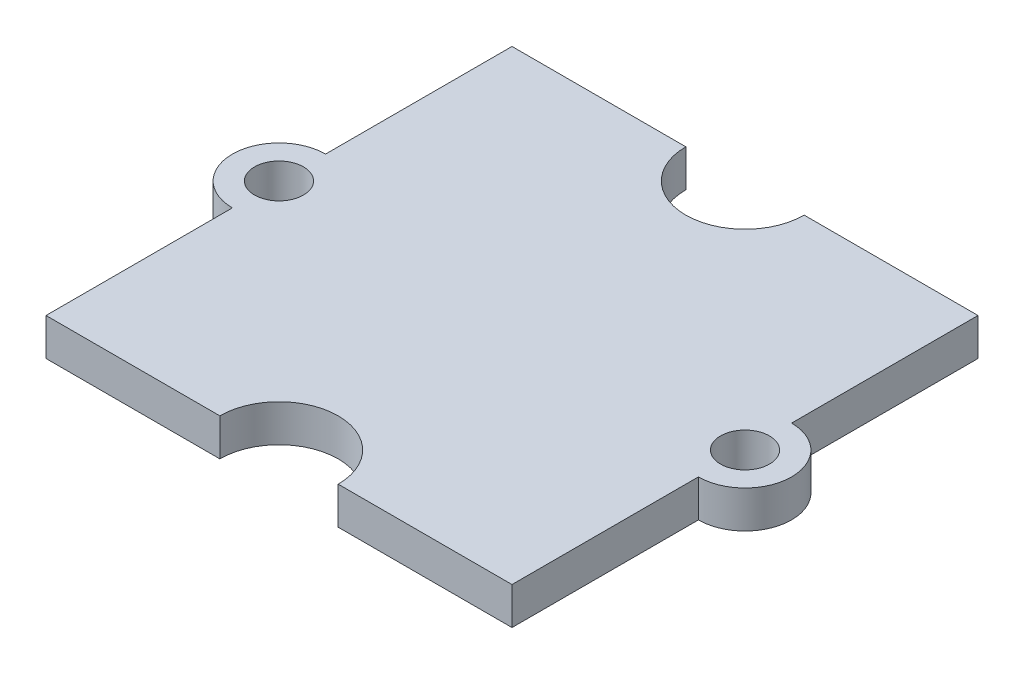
ISO-10303-21;
HEADER;
FILE_DESCRIPTION(('STEP AP214'),'2;1');
FILE_NAME('part.step','',(''),(''),'','','');
FILE_SCHEMA(('AUTOMOTIVE_DESIGN { 1 0 10303 214 1 1 1 1 }'));
ENDSEC;
DATA;
#1=APPLICATION_CONTEXT('core data for automotive mechanical design processes');
#2=APPLICATION_PROTOCOL_DEFINITION('international standard','automotive_design',2000,#1);
#3=PRODUCT_CONTEXT('',#1,'mechanical');
#4=PRODUCT('Part','Part','',(#3));
#5=PRODUCT_RELATED_PRODUCT_CATEGORY('part','',(#4));
#6=PRODUCT_DEFINITION_FORMATION('','',#4);
#7=PRODUCT_DEFINITION_CONTEXT('part definition',#1,'design');
#8=PRODUCT_DEFINITION('design','',#6,#7);
#9=PRODUCT_DEFINITION_SHAPE('','',#8);
#10=(LENGTH_UNIT() NAMED_UNIT(*) SI_UNIT(.MILLI.,.METRE.));
#11=(NAMED_UNIT(*) PLANE_ANGLE_UNIT() SI_UNIT($,.RADIAN.));
#12=(NAMED_UNIT(*) SI_UNIT($,.STERADIAN.) SOLID_ANGLE_UNIT());
#13=UNCERTAINTY_MEASURE_WITH_UNIT(LENGTH_MEASURE(1.E-05),#10,'distance_accuracy_value','');
#14=(GEOMETRIC_REPRESENTATION_CONTEXT(3) GLOBAL_UNCERTAINTY_ASSIGNED_CONTEXT((#13)) GLOBAL_UNIT_ASSIGNED_CONTEXT((#10,
#11,#12)) REPRESENTATION_CONTEXT('',''));
#15=CARTESIAN_POINT('',(0.,0.,0.));
#16=DIRECTION('',(0.,0.,1.));
#17=DIRECTION('',(1.,0.,0.));
#18=AXIS2_PLACEMENT_3D('',#15,#16,#17);
#19=CARTESIAN_POINT('',(-10.,1.6,0.));
#20=DIRECTION('',(0.,-1.,0.));
#21=DIRECTION('',(0.,0.,-1.));
#22=AXIS2_PLACEMENT_3D('',#19,#20,#21);
#23=PLANE('',#22);
#24=DIRECTION('',(0.,0.,1.));
#25=VECTOR('',#24,1.);
#26=CARTESIAN_POINT('',(-10.,1.6,-9.99999999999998));
#27=LINE('',#26,#25);
#28=CARTESIAN_POINT('',(-10.,1.6,-9.99999999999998));
#29=VERTEX_POINT('',#28);
#30=CARTESIAN_POINT('',(-10.,1.6,-1.99999999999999));
#31=VERTEX_POINT('',#30);
#32=EDGE_CURVE('E179',#29,#31,#27,.T.);
#33=ORIENTED_EDGE('',*,*,#32,.T.);
#34=CARTESIAN_POINT('',(-10.,1.6,0.));
#35=DIRECTION('',(0.,1.,0.));
#36=DIRECTION('',(0.,0.,-1.));
#37=AXIS2_PLACEMENT_3D('',#34,#35,#36);
#38=CIRCLE('',#37,2.);
#39=CARTESIAN_POINT('',(-10.,1.6,2.00000000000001));
#40=VERTEX_POINT('',#39);
#41=EDGE_CURVE('E107',#31,#40,#38,.T.);
#42=ORIENTED_EDGE('',*,*,#41,.T.);
#43=DIRECTION('',(0.,0.,1.));
#44=VECTOR('',#43,1.);
#45=CARTESIAN_POINT('',(-10.,1.6,2.00000000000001));
#46=LINE('',#45,#44);
#47=CARTESIAN_POINT('',(-10.,1.6,10.));
#48=VERTEX_POINT('',#47);
#49=EDGE_CURVE('E206',#40,#48,#46,.T.);
#50=ORIENTED_EDGE('',*,*,#49,.T.);
#51=DIRECTION('',(1.,0.,0.));
#52=VECTOR('',#51,1.);
#53=CARTESIAN_POINT('',(-10.,1.6,10.));
#54=LINE('',#53,#52);
#55=CARTESIAN_POINT('',(-2.54,1.6,9.99999999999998));
#56=VERTEX_POINT('',#55);
#57=EDGE_CURVE('E225',#48,#56,#54,.T.);
#58=ORIENTED_EDGE('',*,*,#57,.T.);
#59=CARTESIAN_POINT('',(0.,1.6,9.99999999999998));
#60=DIRECTION('',(0.,-1.,0.));
#61=DIRECTION('',(0.,0.,-1.));
#62=AXIS2_PLACEMENT_3D('',#59,#60,#61);
#63=CIRCLE('',#62,2.54);
#64=CARTESIAN_POINT('',(2.53999999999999,1.6,9.99999999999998));
#65=VERTEX_POINT('',#64);
#66=EDGE_CURVE('E222',#56,#65,#63,.T.);
#67=ORIENTED_EDGE('',*,*,#66,.T.);
#68=DIRECTION('',(1.,0.,0.));
#69=VECTOR('',#68,1.);
#70=CARTESIAN_POINT('',(2.53999999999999,1.6,9.99999999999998));
#71=LINE('',#70,#69);
#72=CARTESIAN_POINT('',(10.,1.6,10.));
#73=VERTEX_POINT('',#72);
#74=EDGE_CURVE('E224',#65,#73,#71,.T.);
#75=ORIENTED_EDGE('',*,*,#74,.T.);
#76=DIRECTION('',(0.,0.,-1.));
#77=VECTOR('',#76,1.);
#78=CARTESIAN_POINT('',(10.,1.6,2.00000000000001));
#79=LINE('',#78,#77);
#80=CARTESIAN_POINT('',(10.,1.6,2.00000000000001));
#81=VERTEX_POINT('',#80);
#82=EDGE_CURVE('E227',#73,#81,#79,.T.);
#83=ORIENTED_EDGE('',*,*,#82,.T.);
#84=CARTESIAN_POINT('',(10.,1.6,0.));
#85=DIRECTION('',(0.,1.,0.));
#86=DIRECTION('',(0.,0.,1.));
#87=AXIS2_PLACEMENT_3D('',#84,#85,#86);
#88=CIRCLE('',#87,2.);
#89=CARTESIAN_POINT('',(10.,1.6,-1.99999999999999));
#90=VERTEX_POINT('',#89);
#91=EDGE_CURVE('E233',#81,#90,#88,.T.);
#92=ORIENTED_EDGE('',*,*,#91,.T.);
#93=DIRECTION('',(0.,0.,-1.));
#94=VECTOR('',#93,1.);
#95=CARTESIAN_POINT('',(10.,1.6,-9.99999999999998));
#96=LINE('',#95,#94);
#97=CARTESIAN_POINT('',(10.,1.6,-9.99999999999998));
#98=VERTEX_POINT('',#97);
#99=EDGE_CURVE('E138',#90,#98,#96,.T.);
#100=ORIENTED_EDGE('',*,*,#99,.T.);
#101=DIRECTION('',(-1.,0.,0.));
#102=VECTOR('',#101,1.);
#103=CARTESIAN_POINT('',(2.54,1.6,-9.99999999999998));
#104=LINE('',#103,#102);
#105=CARTESIAN_POINT('',(2.54,1.6,-9.99999999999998));
#106=VERTEX_POINT('',#105);
#107=EDGE_CURVE('E132',#98,#106,#104,.T.);
#108=ORIENTED_EDGE('',*,*,#107,.T.);
#109=CARTESIAN_POINT('',(0.,1.6,-9.99999999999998));
#110=DIRECTION('',(0.,-1.,0.));
#111=DIRECTION('',(0.,0.,1.));
#112=AXIS2_PLACEMENT_3D('',#109,#110,#111);
#113=CIRCLE('',#112,2.54);
#114=CARTESIAN_POINT('',(-2.54,1.6,-9.99999999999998));
#115=VERTEX_POINT('',#114);
#116=EDGE_CURVE('E136',#106,#115,#113,.T.);
#117=ORIENTED_EDGE('',*,*,#116,.T.);
#118=DIRECTION('',(-1.,0.,0.));
#119=VECTOR('',#118,1.);
#120=CARTESIAN_POINT('',(-10.,1.6,-9.99999999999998));
#121=LINE('',#120,#119);
#122=EDGE_CURVE('E52',#115,#29,#121,.T.);
#123=ORIENTED_EDGE('',*,*,#122,.T.);
#124=EDGE_LOOP('',(#33,#42,#50,#58,#67,#75,#83,#92,#100,#108,#117,#123));
#125=FACE_BOUND('',#124,.T.);
#126=CARTESIAN_POINT('',(10.,1.6,0.));
#127=DIRECTION('',(0.,1.,0.));
#128=DIRECTION('',(0.,0.,1.));
#129=AXIS2_PLACEMENT_3D('',#126,#127,#128);
#130=CIRCLE('',#129,1.05);
#131=CARTESIAN_POINT('',(10.,1.6,1.05000000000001));
#132=VERTEX_POINT('',#131);
#133=EDGE_CURVE('E160',#132,#132,#130,.T.);
#134=ORIENTED_EDGE('',*,*,#133,.F.);
#135=EDGE_LOOP('',(#134));
#136=FACE_BOUND('',#135,.T.);
#137=CARTESIAN_POINT('',(-10.,1.6,0.));
#138=DIRECTION('',(0.,1.,0.));
#139=DIRECTION('',(0.,0.,-1.));
#140=AXIS2_PLACEMENT_3D('',#137,#138,#139);
#141=CIRCLE('',#140,1.05);
#142=CARTESIAN_POINT('',(-10.,1.6,-1.04999999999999));
#143=VERTEX_POINT('',#142);
#144=EDGE_CURVE('E274',#143,#143,#141,.T.);
#145=ORIENTED_EDGE('',*,*,#144,.F.);
#146=EDGE_LOOP('',(#145));
#147=FACE_BOUND('',#146,.T.);
#148=ADVANCED_FACE('F35',(#125,#136,#147),#23,.F.);
#149=CARTESIAN_POINT('',(-10.,0.,0.));
#150=DIRECTION('',(0.,-1.,0.));
#151=DIRECTION('',(0.,0.,-1.));
#152=AXIS2_PLACEMENT_3D('',#149,#150,#151);
#153=PLANE('',#152);
#154=CARTESIAN_POINT('',(10.,0.,0.));
#155=DIRECTION('',(0.,1.,0.));
#156=DIRECTION('',(0.,0.,1.));
#157=AXIS2_PLACEMENT_3D('',#154,#155,#156);
#158=CIRCLE('',#157,1.05);
#159=CARTESIAN_POINT('',(10.,0.,1.05000000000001));
#160=VERTEX_POINT('',#159);
#161=EDGE_CURVE('E279',#160,#160,#158,.T.);
#162=ORIENTED_EDGE('',*,*,#161,.T.);
#163=EDGE_LOOP('',(#162));
#164=FACE_BOUND('',#163,.T.);
#165=DIRECTION('',(0.,0.,1.));
#166=VECTOR('',#165,1.);
#167=CARTESIAN_POINT('',(-10.,0.,-9.99999999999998));
#168=LINE('',#167,#166);
#169=CARTESIAN_POINT('',(-10.,0.,-9.99999999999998));
#170=VERTEX_POINT('',#169);
#171=CARTESIAN_POINT('',(-10.,0.,-1.99999999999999));
#172=VERTEX_POINT('',#171);
#173=EDGE_CURVE('E156',#170,#172,#168,.T.);
#174=ORIENTED_EDGE('',*,*,#173,.F.);
#175=DIRECTION('',(-1.,0.,0.));
#176=VECTOR('',#175,1.);
#177=CARTESIAN_POINT('',(-10.,0.,-9.99999999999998));
#178=LINE('',#177,#176);
#179=CARTESIAN_POINT('',(-2.54,0.,-9.99999999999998));
#180=VERTEX_POINT('',#179);
#181=EDGE_CURVE('E99',#180,#170,#178,.T.);
#182=ORIENTED_EDGE('',*,*,#181,.F.);
#183=CARTESIAN_POINT('',(0.,0.,-9.99999999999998));
#184=DIRECTION('',(0.,-1.,0.));
#185=DIRECTION('',(0.,0.,1.));
#186=AXIS2_PLACEMENT_3D('',#183,#184,#185);
#187=CIRCLE('',#186,2.54);
#188=CARTESIAN_POINT('',(2.54,0.,-9.99999999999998));
#189=VERTEX_POINT('',#188);
#190=EDGE_CURVE('E93',#189,#180,#187,.T.);
#191=ORIENTED_EDGE('',*,*,#190,.F.);
#192=DIRECTION('',(-1.,0.,0.));
#193=VECTOR('',#192,1.);
#194=CARTESIAN_POINT('',(2.54,0.,-9.99999999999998));
#195=LINE('',#194,#193);
#196=CARTESIAN_POINT('',(10.,0.,-9.99999999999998));
#197=VERTEX_POINT('',#196);
#198=EDGE_CURVE('E146',#197,#189,#195,.T.);
#199=ORIENTED_EDGE('',*,*,#198,.F.);
#200=DIRECTION('',(0.,0.,-1.));
#201=VECTOR('',#200,1.);
#202=CARTESIAN_POINT('',(10.,0.,-9.99999999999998));
#203=LINE('',#202,#201);
#204=CARTESIAN_POINT('',(10.,0.,-1.99999999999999));
#205=VERTEX_POINT('',#204);
#206=EDGE_CURVE('E174',#205,#197,#203,.T.);
#207=ORIENTED_EDGE('',*,*,#206,.F.);
#208=CARTESIAN_POINT('',(10.,0.,0.));
#209=DIRECTION('',(0.,1.,0.));
#210=DIRECTION('',(0.,0.,1.));
#211=AXIS2_PLACEMENT_3D('',#208,#209,#210);
#212=CIRCLE('',#211,2.);
#213=CARTESIAN_POINT('',(10.,0.,2.00000000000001));
#214=VERTEX_POINT('',#213);
#215=EDGE_CURVE('E172',#214,#205,#212,.T.);
#216=ORIENTED_EDGE('',*,*,#215,.F.);
#217=DIRECTION('',(0.,0.,-1.));
#218=VECTOR('',#217,1.);
#219=CARTESIAN_POINT('',(10.,0.,2.00000000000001));
#220=LINE('',#219,#218);
#221=CARTESIAN_POINT('',(10.,0.,10.));
#222=VERTEX_POINT('',#221);
#223=EDGE_CURVE('E170',#222,#214,#220,.T.);
#224=ORIENTED_EDGE('',*,*,#223,.F.);
#225=DIRECTION('',(1.,0.,0.));
#226=VECTOR('',#225,1.);
#227=CARTESIAN_POINT('',(2.53999999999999,0.,9.99999999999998));
#228=LINE('',#227,#226);
#229=CARTESIAN_POINT('',(2.53999999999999,0.,9.99999999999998));
#230=VERTEX_POINT('',#229);
#231=EDGE_CURVE('E168',#230,#222,#228,.T.);
#232=ORIENTED_EDGE('',*,*,#231,.F.);
#233=CARTESIAN_POINT('',(0.,0.,9.99999999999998));
#234=DIRECTION('',(0.,-1.,0.));
#235=DIRECTION('',(0.,0.,-1.));
#236=AXIS2_PLACEMENT_3D('',#233,#234,#235);
#237=CIRCLE('',#236,2.54);
#238=CARTESIAN_POINT('',(-2.54,0.,9.99999999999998));
#239=VERTEX_POINT('',#238);
#240=EDGE_CURVE('E166',#239,#230,#237,.T.);
#241=ORIENTED_EDGE('',*,*,#240,.F.);
#242=DIRECTION('',(1.,0.,0.));
#243=VECTOR('',#242,1.);
#244=CARTESIAN_POINT('',(-10.,0.,10.));
#245=LINE('',#244,#243);
#246=CARTESIAN_POINT('',(-10.,0.,10.));
#247=VERTEX_POINT('',#246);
#248=EDGE_CURVE('E164',#247,#239,#245,.T.);
#249=ORIENTED_EDGE('',*,*,#248,.F.);
#250=DIRECTION('',(0.,0.,1.));
#251=VECTOR('',#250,1.);
#252=CARTESIAN_POINT('',(-10.,0.,2.00000000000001));
#253=LINE('',#252,#251);
#254=CARTESIAN_POINT('',(-10.,0.,2.00000000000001));
#255=VERTEX_POINT('',#254);
#256=EDGE_CURVE('E162',#255,#247,#253,.T.);
#257=ORIENTED_EDGE('',*,*,#256,.F.);
#258=CARTESIAN_POINT('',(-10.,0.,0.));
#259=DIRECTION('',(0.,1.,0.));
#260=DIRECTION('',(0.,0.,-1.));
#261=AXIS2_PLACEMENT_3D('',#258,#259,#260);
#262=CIRCLE('',#261,2.);
#263=EDGE_CURVE('E159',#172,#255,#262,.T.);
#264=ORIENTED_EDGE('',*,*,#263,.F.);
#265=EDGE_LOOP('',(#174,#182,#191,#199,#207,#216,#224,#232,#241,#249,#257,#264));
#266=FACE_BOUND('',#265,.T.);
#267=CARTESIAN_POINT('',(-10.,0.,0.));
#268=DIRECTION('',(0.,1.,0.));
#269=DIRECTION('',(0.,0.,-1.));
#270=AXIS2_PLACEMENT_3D('',#267,#268,#269);
#271=CIRCLE('',#270,1.05);
#272=CARTESIAN_POINT('',(-10.,0.,-1.04999999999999));
#273=VERTEX_POINT('',#272);
#274=EDGE_CURVE('E277',#273,#273,#271,.T.);
#275=ORIENTED_EDGE('',*,*,#274,.T.);
#276=EDGE_LOOP('',(#275));
#277=FACE_BOUND('',#276,.T.);
#278=ADVANCED_FACE('F210',(#164,#266,#277),#153,.T.);
#279=CARTESIAN_POINT('',(-10.,1.6,-9.99999999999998));
#280=DIRECTION('',(1.,0.,0.));
#281=DIRECTION('',(0.,0.,-1.));
#282=AXIS2_PLACEMENT_3D('',#279,#280,#281);
#283=PLANE('',#282);
#284=ORIENTED_EDGE('',*,*,#173,.T.);
#285=DIRECTION('',(0.,-1.,0.));
#286=VECTOR('',#285,1.);
#287=CARTESIAN_POINT('',(-10.,1.6,-1.99999999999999));
#288=LINE('',#287,#286);
#289=EDGE_CURVE('E11',#31,#172,#288,.T.);
#290=ORIENTED_EDGE('',*,*,#289,.F.);
#291=ORIENTED_EDGE('',*,*,#32,.F.);
#292=DIRECTION('',(0.,-1.,0.));
#293=VECTOR('',#292,1.);
#294=CARTESIAN_POINT('',(-10.,1.6,-9.99999999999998));
#295=LINE('',#294,#293);
#296=EDGE_CURVE('E152',#29,#170,#295,.T.);
#297=ORIENTED_EDGE('',*,*,#296,.T.);
#298=EDGE_LOOP('',(#284,#290,#291,#297));
#299=FACE_BOUND('',#298,.T.);
#300=ADVANCED_FACE('F37',(#299),#283,.F.);
#301=CARTESIAN_POINT('',(-10.,1.6,0.));
#302=DIRECTION('',(0.,-1.,0.));
#303=DIRECTION('',(0.,0.,-1.));
#304=AXIS2_PLACEMENT_3D('',#301,#302,#303);
#305=CYLINDRICAL_SURFACE('',#304,2.);
#306=ORIENTED_EDGE('',*,*,#263,.T.);
#307=DIRECTION('',(0.,-1.,0.));
#308=VECTOR('',#307,1.);
#309=CARTESIAN_POINT('',(-10.,1.6,2.00000000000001));
#310=LINE('',#309,#308);
#311=EDGE_CURVE('E44',#40,#255,#310,.T.);
#312=ORIENTED_EDGE('',*,*,#311,.F.);
#313=ORIENTED_EDGE('',*,*,#41,.F.);
#314=ORIENTED_EDGE('',*,*,#289,.T.);
#315=EDGE_LOOP('',(#306,#312,#313,#314));
#316=FACE_BOUND('',#315,.T.);
#317=ADVANCED_FACE('F374',(#316),#305,.T.);
#318=CARTESIAN_POINT('',(-10.,1.6,2.00000000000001));
#319=DIRECTION('',(1.,0.,0.));
#320=DIRECTION('',(0.,0.,-1.));
#321=AXIS2_PLACEMENT_3D('',#318,#319,#320);
#322=PLANE('',#321);
#323=ORIENTED_EDGE('',*,*,#256,.T.);
#324=DIRECTION('',(0.,-1.,0.));
#325=VECTOR('',#324,1.);
#326=CARTESIAN_POINT('',(-10.,1.6,10.));
#327=LINE('',#326,#325);
#328=EDGE_CURVE('E198',#48,#247,#327,.T.);
#329=ORIENTED_EDGE('',*,*,#328,.F.);
#330=ORIENTED_EDGE('',*,*,#49,.F.);
#331=ORIENTED_EDGE('',*,*,#311,.T.);
#332=EDGE_LOOP('',(#323,#329,#330,#331));
#333=FACE_BOUND('',#332,.T.);
#334=ADVANCED_FACE('F204',(#333),#322,.F.);
#335=CARTESIAN_POINT('',(-10.,1.6,10.));
#336=DIRECTION('',(0.,0.,-1.));
#337=DIRECTION('',(-1.,0.,0.));
#338=AXIS2_PLACEMENT_3D('',#335,#336,#337);
#339=PLANE('',#338);
#340=ORIENTED_EDGE('',*,*,#248,.T.);
#341=DIRECTION('',(0.,-1.,0.));
#342=VECTOR('',#341,1.);
#343=CARTESIAN_POINT('',(-2.54,1.6,9.99999999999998));
#344=LINE('',#343,#342);
#345=EDGE_CURVE('E195',#56,#239,#344,.T.);
#346=ORIENTED_EDGE('',*,*,#345,.F.);
#347=ORIENTED_EDGE('',*,*,#57,.F.);
#348=ORIENTED_EDGE('',*,*,#328,.T.);
#349=EDGE_LOOP('',(#340,#346,#347,#348));
#350=FACE_BOUND('',#349,.T.);
#351=ADVANCED_FACE('F216',(#350),#339,.F.);
#352=CARTESIAN_POINT('',(0.,1.6,9.99999999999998));
#353=DIRECTION('',(0.,-1.,0.));
#354=DIRECTION('',(0.,0.,-1.));
#355=AXIS2_PLACEMENT_3D('',#352,#353,#354);
#356=CYLINDRICAL_SURFACE('',#355,2.54);
#357=ORIENTED_EDGE('',*,*,#240,.T.);
#358=DIRECTION('',(0.,-1.,0.));
#359=VECTOR('',#358,1.);
#360=CARTESIAN_POINT('',(2.53999999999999,1.6,9.99999999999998));
#361=LINE('',#360,#359);
#362=EDGE_CURVE('E192',#65,#230,#361,.T.);
#363=ORIENTED_EDGE('',*,*,#362,.F.);
#364=ORIENTED_EDGE('',*,*,#66,.F.);
#365=ORIENTED_EDGE('',*,*,#345,.T.);
#366=EDGE_LOOP('',(#357,#363,#364,#365));
#367=FACE_BOUND('',#366,.T.);
#368=ADVANCED_FACE('F220',(#367),#356,.F.);
#369=CARTESIAN_POINT('',(2.53999999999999,1.6,9.99999999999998));
#370=DIRECTION('',(0.,0.,-1.));
#371=DIRECTION('',(-1.,0.,0.));
#372=AXIS2_PLACEMENT_3D('',#369,#370,#371);
#373=PLANE('',#372);
#374=ORIENTED_EDGE('',*,*,#231,.T.);
#375=DIRECTION('',(0.,-1.,0.));
#376=VECTOR('',#375,1.);
#377=CARTESIAN_POINT('',(10.,1.6,10.));
#378=LINE('',#377,#376);
#379=EDGE_CURVE('E189',#73,#222,#378,.T.);
#380=ORIENTED_EDGE('',*,*,#379,.F.);
#381=ORIENTED_EDGE('',*,*,#74,.F.);
#382=ORIENTED_EDGE('',*,*,#362,.T.);
#383=EDGE_LOOP('',(#374,#380,#381,#382));
#384=FACE_BOUND('',#383,.T.);
#385=ADVANCED_FACE('F339',(#384),#373,.F.);
#386=CARTESIAN_POINT('',(10.,1.6,2.00000000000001));
#387=DIRECTION('',(-1.,0.,0.));
#388=DIRECTION('',(0.,0.,1.));
#389=AXIS2_PLACEMENT_3D('',#386,#387,#388);
#390=PLANE('',#389);
#391=ORIENTED_EDGE('',*,*,#223,.T.);
#392=DIRECTION('',(0.,-1.,0.));
#393=VECTOR('',#392,1.);
#394=CARTESIAN_POINT('',(10.,1.6,2.00000000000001));
#395=LINE('',#394,#393);
#396=EDGE_CURVE('E186',#81,#214,#395,.T.);
#397=ORIENTED_EDGE('',*,*,#396,.F.);
#398=ORIENTED_EDGE('',*,*,#82,.F.);
#399=ORIENTED_EDGE('',*,*,#379,.T.);
#400=EDGE_LOOP('',(#391,#397,#398,#399));
#401=FACE_BOUND('',#400,.T.);
#402=ADVANCED_FACE('F330',(#401),#390,.F.);
#403=CARTESIAN_POINT('',(10.,1.6,0.));
#404=DIRECTION('',(0.,-1.,0.));
#405=DIRECTION('',(0.,0.,-1.));
#406=AXIS2_PLACEMENT_3D('',#403,#404,#405);
#407=CYLINDRICAL_SURFACE('',#406,2.);
#408=ORIENTED_EDGE('',*,*,#215,.T.);
#409=DIRECTION('',(0.,-1.,0.));
#410=VECTOR('',#409,1.);
#411=CARTESIAN_POINT('',(10.,1.6,-1.99999999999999));
#412=LINE('',#411,#410);
#413=EDGE_CURVE('E183',#90,#205,#412,.T.);
#414=ORIENTED_EDGE('',*,*,#413,.F.);
#415=ORIENTED_EDGE('',*,*,#91,.F.);
#416=ORIENTED_EDGE('',*,*,#396,.T.);
#417=EDGE_LOOP('',(#408,#414,#415,#416));
#418=FACE_BOUND('',#417,.T.);
#419=ADVANCED_FACE('F239',(#418),#407,.T.);
#420=CARTESIAN_POINT('',(10.,1.6,-9.99999999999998));
#421=DIRECTION('',(-1.,0.,0.));
#422=DIRECTION('',(0.,0.,1.));
#423=AXIS2_PLACEMENT_3D('',#420,#421,#422);
#424=PLANE('',#423);
#425=ORIENTED_EDGE('',*,*,#206,.T.);
#426=DIRECTION('',(0.,-1.,0.));
#427=VECTOR('',#426,1.);
#428=CARTESIAN_POINT('',(10.,1.6,-9.99999999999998));
#429=LINE('',#428,#427);
#430=EDGE_CURVE('E147',#98,#197,#429,.T.);
#431=ORIENTED_EDGE('',*,*,#430,.F.);
#432=ORIENTED_EDGE('',*,*,#99,.F.);
#433=ORIENTED_EDGE('',*,*,#413,.T.);
#434=EDGE_LOOP('',(#425,#431,#432,#433));
#435=FACE_BOUND('',#434,.T.);
#436=ADVANCED_FACE('F243',(#435),#424,.F.);
#437=CARTESIAN_POINT('',(2.54,1.6,-9.99999999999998));
#438=DIRECTION('',(0.,0.,1.));
#439=DIRECTION('',(1.,0.,0.));
#440=AXIS2_PLACEMENT_3D('',#437,#438,#439);
#441=PLANE('',#440);
#442=ORIENTED_EDGE('',*,*,#198,.T.);
#443=DIRECTION('',(0.,-1.,0.));
#444=VECTOR('',#443,1.);
#445=CARTESIAN_POINT('',(2.54,1.6,-9.99999999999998));
#446=LINE('',#445,#444);
#447=EDGE_CURVE('E143',#106,#189,#446,.T.);
#448=ORIENTED_EDGE('',*,*,#447,.F.);
#449=ORIENTED_EDGE('',*,*,#107,.F.);
#450=ORIENTED_EDGE('',*,*,#430,.T.);
#451=EDGE_LOOP('',(#442,#448,#449,#450));
#452=FACE_BOUND('',#451,.T.);
#453=ADVANCED_FACE('F144',(#452),#441,.F.);
#454=CARTESIAN_POINT('',(0.,1.6,-9.99999999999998));
#455=DIRECTION('',(0.,-1.,0.));
#456=DIRECTION('',(0.,0.,-1.));
#457=AXIS2_PLACEMENT_3D('',#454,#455,#456);
#458=CYLINDRICAL_SURFACE('',#457,2.54);
#459=ORIENTED_EDGE('',*,*,#190,.T.);
#460=DIRECTION('',(0.,-1.,0.));
#461=VECTOR('',#460,1.);
#462=CARTESIAN_POINT('',(-2.54,1.6,-9.99999999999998));
#463=LINE('',#462,#461);
#464=EDGE_CURVE('E148',#115,#180,#463,.T.);
#465=ORIENTED_EDGE('',*,*,#464,.F.);
#466=ORIENTED_EDGE('',*,*,#116,.F.);
#467=ORIENTED_EDGE('',*,*,#447,.T.);
#468=EDGE_LOOP('',(#459,#465,#466,#467));
#469=FACE_BOUND('',#468,.T.);
#470=ADVANCED_FACE('F150',(#469),#458,.F.);
#471=CARTESIAN_POINT('',(-10.,1.6,-9.99999999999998));
#472=DIRECTION('',(0.,0.,1.));
#473=DIRECTION('',(1.,0.,0.));
#474=AXIS2_PLACEMENT_3D('',#471,#472,#473);
#475=PLANE('',#474);
#476=ORIENTED_EDGE('',*,*,#181,.T.);
#477=ORIENTED_EDGE('',*,*,#296,.F.);
#478=ORIENTED_EDGE('',*,*,#122,.F.);
#479=ORIENTED_EDGE('',*,*,#464,.T.);
#480=EDGE_LOOP('',(#476,#477,#478,#479));
#481=FACE_BOUND('',#480,.T.);
#482=ADVANCED_FACE('F247',(#481),#475,.F.);
#483=CARTESIAN_POINT('',(10.,1.6,0.));
#484=DIRECTION('',(0.,-1.,0.));
#485=DIRECTION('',(0.,0.,-1.));
#486=AXIS2_PLACEMENT_3D('',#483,#484,#485);
#487=CYLINDRICAL_SURFACE('',#486,1.05);
#488=ORIENTED_EDGE('',*,*,#133,.T.);
#489=EDGE_LOOP('',(#488));
#490=FACE_BOUND('',#489,.T.);
#491=ORIENTED_EDGE('',*,*,#161,.F.);
#492=EDGE_LOOP('',(#491));
#493=FACE_BOUND('',#492,.T.);
#494=ADVANCED_FACE('F249',(#490,#493),#487,.F.);
#495=CARTESIAN_POINT('',(-10.,1.6,0.));
#496=DIRECTION('',(0.,-1.,0.));
#497=DIRECTION('',(0.,0.,-1.));
#498=AXIS2_PLACEMENT_3D('',#495,#496,#497);
#499=CYLINDRICAL_SURFACE('',#498,1.05);
#500=ORIENTED_EDGE('',*,*,#144,.T.);
#501=EDGE_LOOP('',(#500));
#502=FACE_BOUND('',#501,.T.);
#503=ORIENTED_EDGE('',*,*,#274,.F.);
#504=EDGE_LOOP('',(#503));
#505=FACE_BOUND('',#504,.T.);
#506=ADVANCED_FACE('F255',(#502,#505),#499,.F.);
#507=CLOSED_SHELL('',(#148,#278,#300,#317,#334,#351,#368,#385,#402,#419,#436,#453,#470,#482,
#494,#506));
#508=MANIFOLD_SOLID_BREP('B2',#507);
#509=ADVANCED_BREP_SHAPE_REPRESENTATION('',(#18,#508),#14);
#510=SHAPE_DEFINITION_REPRESENTATION(#9,#509);
ENDSEC;
END-ISO-10303-21;
